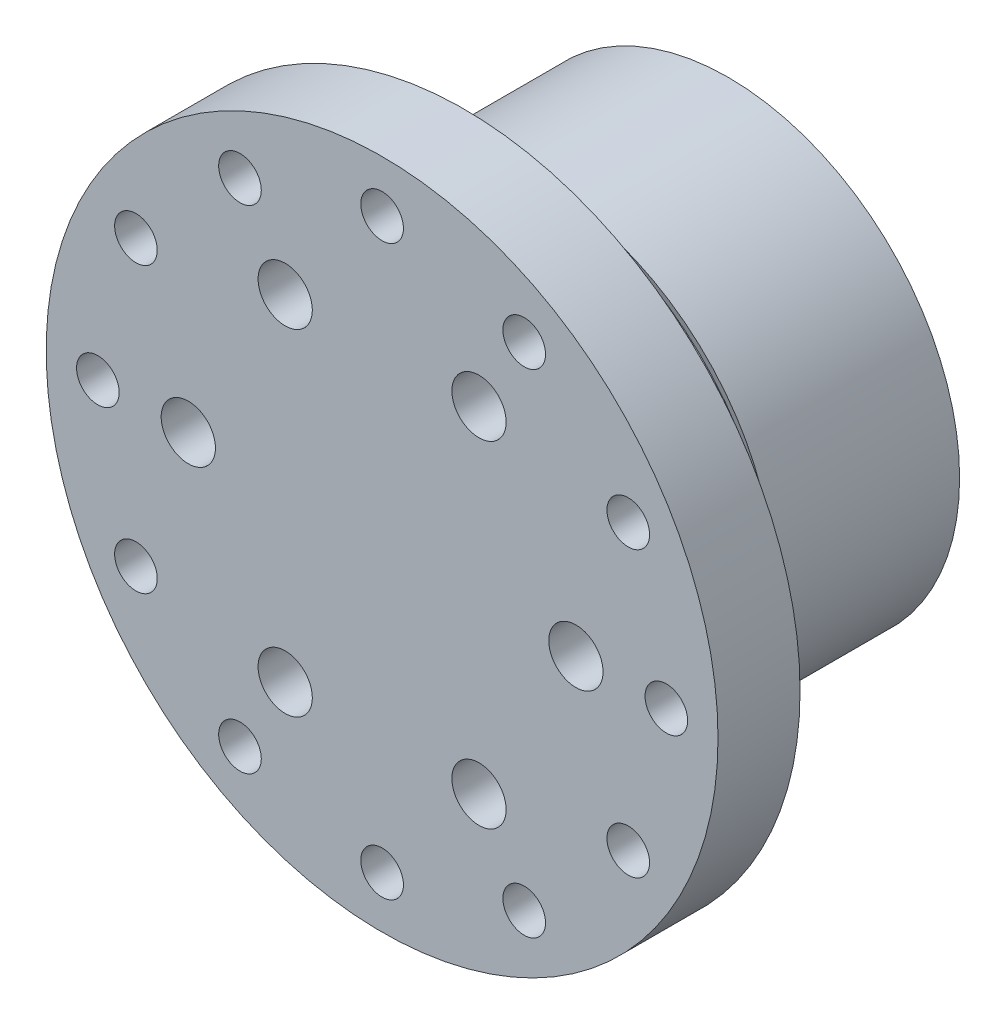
ISO-10303-21;
HEADER;
FILE_DESCRIPTION(('STEP AP214'),'2;1');
FILE_NAME('part.step','',(''),(''),'','','');
FILE_SCHEMA(('AUTOMOTIVE_DESIGN { 1 0 10303 214 1 1 1 1 }'));
ENDSEC;
DATA;
#1=APPLICATION_CONTEXT('core data for automotive mechanical design processes');
#2=APPLICATION_PROTOCOL_DEFINITION('international standard','automotive_design',2000,#1);
#3=PRODUCT_CONTEXT('',#1,'mechanical');
#4=PRODUCT('Part','Part','',(#3));
#5=PRODUCT_RELATED_PRODUCT_CATEGORY('part','',(#4));
#6=PRODUCT_DEFINITION_FORMATION('','',#4);
#7=PRODUCT_DEFINITION_CONTEXT('part definition',#1,'design');
#8=PRODUCT_DEFINITION('design','',#6,#7);
#9=PRODUCT_DEFINITION_SHAPE('','',#8);
#10=(LENGTH_UNIT() NAMED_UNIT(*) SI_UNIT(.MILLI.,.METRE.));
#11=(NAMED_UNIT(*) PLANE_ANGLE_UNIT() SI_UNIT($,.RADIAN.));
#12=(NAMED_UNIT(*) SI_UNIT($,.STERADIAN.) SOLID_ANGLE_UNIT());
#13=UNCERTAINTY_MEASURE_WITH_UNIT(LENGTH_MEASURE(1.E-05),#10,'distance_accuracy_value','');
#14=(GEOMETRIC_REPRESENTATION_CONTEXT(3) GLOBAL_UNCERTAINTY_ASSIGNED_CONTEXT((#13)) GLOBAL_UNIT_ASSIGNED_CONTEXT((#10,
#11,#12)) REPRESENTATION_CONTEXT('',''));
#15=CARTESIAN_POINT('',(0.,0.,0.));
#16=DIRECTION('',(0.,0.,1.));
#17=DIRECTION('',(1.,0.,0.));
#18=AXIS2_PLACEMENT_3D('',#15,#16,#17);
#19=CARTESIAN_POINT('',(0.,0.,0.));
#20=DIRECTION('',(0.,0.,1.));
#21=DIRECTION('',(1.,0.,0.));
#22=AXIS2_PLACEMENT_3D('',#19,#20,#21);
#23=PLANE('',#22);
#24=CARTESIAN_POINT('',(7.5,-12.9903810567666,0.));
#25=DIRECTION('',(0.,0.,1.));
#26=DIRECTION('',(1.,0.,0.));
#27=AXIS2_PLACEMENT_3D('',#24,#25,#26);
#28=CIRCLE('',#27,2.1);
#29=CARTESIAN_POINT('',(9.6,-12.9903810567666,0.));
#30=VERTEX_POINT('',#29);
#31=EDGE_CURVE('E153',#30,#30,#28,.T.);
#32=ORIENTED_EDGE('',*,*,#31,.T.);
#33=EDGE_LOOP('',(#32));
#34=FACE_BOUND('',#33,.T.);
#35=CARTESIAN_POINT('',(-7.5,-12.9903810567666,0.));
#36=DIRECTION('',(0.,0.,1.));
#37=DIRECTION('',(1.,0.,0.));
#38=AXIS2_PLACEMENT_3D('',#35,#36,#37);
#39=CIRCLE('',#38,2.1);
#40=CARTESIAN_POINT('',(-5.4,-12.9903810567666,0.));
#41=VERTEX_POINT('',#40);
#42=EDGE_CURVE('E162',#41,#41,#39,.T.);
#43=ORIENTED_EDGE('',*,*,#42,.T.);
#44=EDGE_LOOP('',(#43));
#45=FACE_BOUND('',#44,.T.);
#46=CARTESIAN_POINT('',(-15.,0.,0.));
#47=DIRECTION('',(0.,0.,1.));
#48=DIRECTION('',(1.,0.,0.));
#49=AXIS2_PLACEMENT_3D('',#46,#47,#48);
#50=CIRCLE('',#49,2.1);
#51=CARTESIAN_POINT('',(-12.9,0.,0.));
#52=VERTEX_POINT('',#51);
#53=EDGE_CURVE('E167',#52,#52,#50,.T.);
#54=ORIENTED_EDGE('',*,*,#53,.T.);
#55=EDGE_LOOP('',(#54));
#56=FACE_BOUND('',#55,.T.);
#57=CARTESIAN_POINT('',(-7.50000000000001,12.9903810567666,0.));
#58=DIRECTION('',(0.,0.,1.));
#59=DIRECTION('',(1.,0.,0.));
#60=AXIS2_PLACEMENT_3D('',#57,#58,#59);
#61=CIRCLE('',#60,2.1);
#62=CARTESIAN_POINT('',(-5.40000000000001,12.9903810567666,0.));
#63=VERTEX_POINT('',#62);
#64=EDGE_CURVE('E174',#63,#63,#61,.T.);
#65=ORIENTED_EDGE('',*,*,#64,.T.);
#66=EDGE_LOOP('',(#65));
#67=FACE_BOUND('',#66,.T.);
#68=CARTESIAN_POINT('',(7.5,12.9903810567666,0.));
#69=DIRECTION('',(0.,0.,1.));
#70=DIRECTION('',(1.,0.,0.));
#71=AXIS2_PLACEMENT_3D('',#68,#69,#70);
#72=CIRCLE('',#71,2.1);
#73=CARTESIAN_POINT('',(9.6,12.9903810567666,0.));
#74=VERTEX_POINT('',#73);
#75=EDGE_CURVE('E164',#74,#74,#72,.T.);
#76=ORIENTED_EDGE('',*,*,#75,.T.);
#77=EDGE_LOOP('',(#76));
#78=FACE_BOUND('',#77,.T.);
#79=CARTESIAN_POINT('',(15.,0.,0.));
#80=DIRECTION('',(0.,0.,1.));
#81=DIRECTION('',(1.,0.,0.));
#82=AXIS2_PLACEMENT_3D('',#79,#80,#81);
#83=CIRCLE('',#82,2.1);
#84=CARTESIAN_POINT('',(17.1,0.,0.));
#85=VERTEX_POINT('',#84);
#86=EDGE_CURVE('E149',#85,#85,#83,.T.);
#87=ORIENTED_EDGE('',*,*,#86,.T.);
#88=EDGE_LOOP('',(#87));
#89=FACE_BOUND('',#88,.T.);
#90=CARTESIAN_POINT('',(-12.3408620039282,-7.12500000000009,0.));
#91=DIRECTION('',(0.,0.,-1.));
#92=DIRECTION('',(-1.,0.,0.));
#93=AXIS2_PLACEMENT_3D('',#90,#91,#92);
#94=CIRCLE('',#93,3.);
#95=CARTESIAN_POINT('',(-15.3408620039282,-7.12500000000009,0.));
#96=VERTEX_POINT('',#95);
#97=EDGE_CURVE('E367',#96,#96,#94,.T.);
#98=ORIENTED_EDGE('',*,*,#97,.F.);
#99=EDGE_LOOP('',(#98));
#100=FACE_BOUND('',#99,.T.);
#101=CARTESIAN_POINT('',(0.,14.25,0.));
#102=DIRECTION('',(0.,0.,-1.));
#103=DIRECTION('',(-1.,0.,0.));
#104=AXIS2_PLACEMENT_3D('',#101,#102,#103);
#105=CIRCLE('',#104,3.);
#106=CARTESIAN_POINT('',(-3.00000000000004,14.25,0.));
#107=VERTEX_POINT('',#106);
#108=EDGE_CURVE('E382',#107,#107,#105,.T.);
#109=ORIENTED_EDGE('',*,*,#108,.F.);
#110=EDGE_LOOP('',(#109));
#111=FACE_BOUND('',#110,.T.);
#112=CARTESIAN_POINT('',(12.3408620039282,-7.12500000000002,0.));
#113=DIRECTION('',(0.,0.,-1.));
#114=DIRECTION('',(-1.,0.,0.));
#115=AXIS2_PLACEMENT_3D('',#112,#113,#114);
#116=CIRCLE('',#115,3.);
#117=CARTESIAN_POINT('',(9.34086200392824,-7.12500000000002,0.));
#118=VERTEX_POINT('',#117);
#119=EDGE_CURVE('E383',#118,#118,#116,.T.);
#120=ORIENTED_EDGE('',*,*,#119,.F.);
#121=EDGE_LOOP('',(#120));
#122=FACE_BOUND('',#121,.T.);
#123=CARTESIAN_POINT('',(0.,0.,0.));
#124=DIRECTION('',(0.,0.,-1.));
#125=DIRECTION('',(-1.,0.,0.));
#126=AXIS2_PLACEMENT_3D('',#123,#124,#125);
#127=CIRCLE('',#126,17.9);
#128=CARTESIAN_POINT('',(-17.9,0.,0.));
#129=VERTEX_POINT('',#128);
#130=EDGE_CURVE('E427',#129,#129,#127,.T.);
#131=ORIENTED_EDGE('',*,*,#130,.T.);
#132=EDGE_LOOP('',(#131));
#133=FACE_BOUND('',#132,.T.);
#134=ADVANCED_FACE('F48',(#34,#45,#56,#67,#78,#89,#100,#111,#122,#133),#23,.F.);
#135=CARTESIAN_POINT('',(0.,0.,20.45));
#136=DIRECTION('',(0.,0.,-1.));
#137=DIRECTION('',(-1.,0.,0.));
#138=AXIS2_PLACEMENT_3D('',#135,#136,#137);
#139=CYLINDRICAL_SURFACE('',#138,18.9);
#140=CARTESIAN_POINT('',(0.,0.,15.35));
#141=DIRECTION('',(0.,0.,1.));
#142=DIRECTION('',(1.,0.,0.));
#143=AXIS2_PLACEMENT_3D('',#140,#141,#142);
#144=CIRCLE('',#143,18.9);
#145=CARTESIAN_POINT('',(18.9,0.,15.35));
#146=VERTEX_POINT('',#145);
#147=EDGE_CURVE('E440',#146,#146,#144,.F.);
#148=ORIENTED_EDGE('',*,*,#147,.F.);
#149=EDGE_LOOP('',(#148));
#150=FACE_BOUND('',#149,.T.);
#151=CARTESIAN_POINT('',(0.,0.,20.45));
#152=DIRECTION('',(0.,0.,1.));
#153=DIRECTION('',(1.,0.,0.));
#154=AXIS2_PLACEMENT_3D('',#151,#152,#153);
#155=CIRCLE('',#154,18.9);
#156=CARTESIAN_POINT('',(18.9,0.,20.45));
#157=VERTEX_POINT('',#156);
#158=EDGE_CURVE('E60',#157,#157,#155,.T.);
#159=ORIENTED_EDGE('',*,*,#158,.F.);
#160=EDGE_LOOP('',(#159));
#161=FACE_BOUND('',#160,.T.);
#162=ADVANCED_FACE('F270',(#150,#161),#139,.T.);
#163=CARTESIAN_POINT('',(0.,0.,26.8));
#164=DIRECTION('',(0.,0.,-1.));
#165=DIRECTION('',(-1.,0.,0.));
#166=AXIS2_PLACEMENT_3D('',#163,#164,#165);
#167=CYLINDRICAL_SURFACE('',#166,26.);
#168=CARTESIAN_POINT('',(0.,0.,26.8));
#169=DIRECTION('',(0.,0.,1.));
#170=DIRECTION('',(1.,0.,0.));
#171=AXIS2_PLACEMENT_3D('',#168,#169,#170);
#172=CIRCLE('',#171,26.);
#173=CARTESIAN_POINT('',(26.,0.,26.8));
#174=VERTEX_POINT('',#173);
#175=EDGE_CURVE('E61',#174,#174,#172,.T.);
#176=ORIENTED_EDGE('',*,*,#175,.F.);
#177=EDGE_LOOP('',(#176));
#178=FACE_BOUND('',#177,.T.);
#179=CARTESIAN_POINT('',(0.,0.,20.45));
#180=DIRECTION('',(0.,0.,1.));
#181=DIRECTION('',(1.,0.,0.));
#182=AXIS2_PLACEMENT_3D('',#179,#180,#181);
#183=CIRCLE('',#182,26.);
#184=CARTESIAN_POINT('',(26.,0.,20.45));
#185=VERTEX_POINT('',#184);
#186=EDGE_CURVE('E66',#185,#185,#183,.T.);
#187=ORIENTED_EDGE('',*,*,#186,.T.);
#188=EDGE_LOOP('',(#187));
#189=FACE_BOUND('',#188,.T.);
#190=ADVANCED_FACE('F91',(#178,#189),#167,.T.);
#191=CARTESIAN_POINT('',(0.,0.,26.8));
#192=DIRECTION('',(0.,0.,1.));
#193=DIRECTION('',(1.,0.,0.));
#194=AXIS2_PLACEMENT_3D('',#191,#192,#193);
#195=PLANE('',#194);
#196=CARTESIAN_POINT('',(-10.9999999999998,19.0525588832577,26.8));
#197=DIRECTION('',(0.,0.,1.));
#198=DIRECTION('',(1.,0.,0.));
#199=AXIS2_PLACEMENT_3D('',#196,#197,#198);
#200=CIRCLE('',#199,1.65);
#201=CARTESIAN_POINT('',(-9.34999999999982,19.0525588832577,26.8));
#202=VERTEX_POINT('',#201);
#203=EDGE_CURVE('E408',#202,#202,#200,.T.);
#204=ORIENTED_EDGE('',*,*,#203,.F.);
#205=EDGE_LOOP('',(#204));
#206=FACE_BOUND('',#205,.T.);
#207=CARTESIAN_POINT('',(-19.0525588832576,11.0000000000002,26.8));
#208=DIRECTION('',(0.,0.,1.));
#209=DIRECTION('',(1.,0.,0.));
#210=AXIS2_PLACEMENT_3D('',#207,#208,#209);
#211=CIRCLE('',#210,1.65);
#212=CARTESIAN_POINT('',(-17.4025588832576,11.0000000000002,26.8));
#213=VERTEX_POINT('',#212);
#214=EDGE_CURVE('E411',#213,#213,#211,.T.);
#215=ORIENTED_EDGE('',*,*,#214,.F.);
#216=EDGE_LOOP('',(#215));
#217=FACE_BOUND('',#216,.T.);
#218=CARTESIAN_POINT('',(-22.,1.53625178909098E-13,26.8));
#219=DIRECTION('',(0.,0.,1.));
#220=DIRECTION('',(1.,0.,0.));
#221=AXIS2_PLACEMENT_3D('',#218,#219,#220);
#222=CIRCLE('',#221,1.65);
#223=CARTESIAN_POINT('',(-20.35,1.53625178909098E-13,26.8));
#224=VERTEX_POINT('',#223);
#225=EDGE_CURVE('E420',#224,#224,#222,.T.);
#226=ORIENTED_EDGE('',*,*,#225,.F.);
#227=EDGE_LOOP('',(#226));
#228=FACE_BOUND('',#227,.T.);
#229=CARTESIAN_POINT('',(-19.0525588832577,-10.9999999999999,26.8));
#230=DIRECTION('',(0.,0.,1.));
#231=DIRECTION('',(1.,0.,0.));
#232=AXIS2_PLACEMENT_3D('',#229,#230,#231);
#233=CIRCLE('',#232,1.65);
#234=CARTESIAN_POINT('',(-17.4025588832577,-10.9999999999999,26.8));
#235=VERTEX_POINT('',#234);
#236=EDGE_CURVE('E400',#235,#235,#233,.T.);
#237=ORIENTED_EDGE('',*,*,#236,.F.);
#238=EDGE_LOOP('',(#237));
#239=FACE_BOUND('',#238,.T.);
#240=CARTESIAN_POINT('',(-11.0000000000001,-19.0525588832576,26.8));
#241=DIRECTION('',(0.,0.,1.));
#242=DIRECTION('',(1.,0.,0.));
#243=AXIS2_PLACEMENT_3D('',#240,#241,#242);
#244=CIRCLE('',#243,1.65);
#245=CARTESIAN_POINT('',(-9.35000000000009,-19.0525588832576,26.8));
#246=VERTEX_POINT('',#245);
#247=EDGE_CURVE('E391',#246,#246,#244,.T.);
#248=ORIENTED_EDGE('',*,*,#247,.F.);
#249=EDGE_LOOP('',(#248));
#250=FACE_BOUND('',#249,.T.);
#251=CARTESIAN_POINT('',(0.,-22.,26.8));
#252=DIRECTION('',(0.,0.,1.));
#253=DIRECTION('',(1.,0.,0.));
#254=AXIS2_PLACEMENT_3D('',#251,#252,#253);
#255=CIRCLE('',#254,1.65);
#256=CARTESIAN_POINT('',(1.64999999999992,-22.,26.8));
#257=VERTEX_POINT('',#256);
#258=EDGE_CURVE('E399',#257,#257,#255,.T.);
#259=ORIENTED_EDGE('',*,*,#258,.F.);
#260=EDGE_LOOP('',(#259));
#261=FACE_BOUND('',#260,.T.);
#262=CARTESIAN_POINT('',(11.,-19.0525588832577,26.8));
#263=DIRECTION('',(0.,0.,1.));
#264=DIRECTION('',(1.,0.,0.));
#265=AXIS2_PLACEMENT_3D('',#262,#263,#264);
#266=CIRCLE('',#265,1.65);
#267=CARTESIAN_POINT('',(12.65,-19.0525588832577,26.8));
#268=VERTEX_POINT('',#267);
#269=EDGE_CURVE('E405',#268,#268,#266,.T.);
#270=ORIENTED_EDGE('',*,*,#269,.F.);
#271=EDGE_LOOP('',(#270));
#272=FACE_BOUND('',#271,.T.);
#273=CARTESIAN_POINT('',(19.0525588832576,-11.,26.8));
#274=DIRECTION('',(0.,0.,1.));
#275=DIRECTION('',(1.,0.,0.));
#276=AXIS2_PLACEMENT_3D('',#273,#274,#275);
#277=CIRCLE('',#276,1.65);
#278=CARTESIAN_POINT('',(20.7025588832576,-11.,26.8));
#279=VERTEX_POINT('',#278);
#280=EDGE_CURVE('E342',#279,#279,#277,.T.);
#281=ORIENTED_EDGE('',*,*,#280,.F.);
#282=EDGE_LOOP('',(#281));
#283=FACE_BOUND('',#282,.T.);
#284=CARTESIAN_POINT('',(2.30437768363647E-13,22.,26.8));
#285=DIRECTION('',(0.,0.,1.));
#286=DIRECTION('',(1.,0.,0.));
#287=AXIS2_PLACEMENT_3D('',#284,#285,#286);
#288=CIRCLE('',#287,1.65);
#289=CARTESIAN_POINT('',(1.65000000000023,22.,26.8));
#290=VERTEX_POINT('',#289);
#291=EDGE_CURVE('E412',#290,#290,#288,.T.);
#292=ORIENTED_EDGE('',*,*,#291,.F.);
#293=EDGE_LOOP('',(#292));
#294=FACE_BOUND('',#293,.T.);
#295=CARTESIAN_POINT('',(11.0000000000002,19.0525588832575,26.8));
#296=DIRECTION('',(0.,0.,1.));
#297=DIRECTION('',(1.,0.,0.));
#298=AXIS2_PLACEMENT_3D('',#295,#296,#297);
#299=CIRCLE('',#298,1.65);
#300=CARTESIAN_POINT('',(12.6500000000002,19.0525588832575,26.8));
#301=VERTEX_POINT('',#300);
#302=EDGE_CURVE('E429',#301,#301,#299,.T.);
#303=ORIENTED_EDGE('',*,*,#302,.F.);
#304=EDGE_LOOP('',(#303));
#305=FACE_BOUND('',#304,.T.);
#306=CARTESIAN_POINT('',(19.0525588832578,10.9999999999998,26.8));
#307=DIRECTION('',(0.,0.,1.));
#308=DIRECTION('',(1.,0.,0.));
#309=AXIS2_PLACEMENT_3D('',#306,#307,#308);
#310=CIRCLE('',#309,1.65);
#311=CARTESIAN_POINT('',(20.7025588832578,10.9999999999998,26.8));
#312=VERTEX_POINT('',#311);
#313=EDGE_CURVE('E424',#312,#312,#310,.T.);
#314=ORIENTED_EDGE('',*,*,#313,.F.);
#315=EDGE_LOOP('',(#314));
#316=FACE_BOUND('',#315,.T.);
#317=CARTESIAN_POINT('',(22.,0.,26.8));
#318=DIRECTION('',(0.,0.,1.));
#319=DIRECTION('',(1.,0.,0.));
#320=AXIS2_PLACEMENT_3D('',#317,#318,#319);
#321=CIRCLE('',#320,1.65);
#322=CARTESIAN_POINT('',(23.65,0.,26.8));
#323=VERTEX_POINT('',#322);
#324=EDGE_CURVE('E338',#323,#323,#321,.T.);
#325=ORIENTED_EDGE('',*,*,#324,.F.);
#326=EDGE_LOOP('',(#325));
#327=FACE_BOUND('',#326,.T.);
#328=CARTESIAN_POINT('',(15.,0.,26.800012));
#329=DIRECTION('',(0.,0.,1.));
#330=DIRECTION('',(1.,0.,0.));
#331=AXIS2_PLACEMENT_3D('',#328,#329,#330);
#332=CIRCLE('',#331,2.1);
#333=CARTESIAN_POINT('',(17.1,0.,26.800012));
#334=VERTEX_POINT('',#333);
#335=EDGE_CURVE('E145',#334,#334,#332,.T.);
#336=ORIENTED_EDGE('',*,*,#335,.F.);
#337=EDGE_LOOP('',(#336));
#338=FACE_BOUND('',#337,.T.);
#339=CARTESIAN_POINT('',(7.5,12.9903810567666,26.800012));
#340=DIRECTION('',(0.,0.,1.));
#341=DIRECTION('',(1.,0.,0.));
#342=AXIS2_PLACEMENT_3D('',#339,#340,#341);
#343=CIRCLE('',#342,2.1);
#344=CARTESIAN_POINT('',(9.6,12.9903810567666,26.800012));
#345=VERTEX_POINT('',#344);
#346=EDGE_CURVE('E133',#345,#345,#343,.T.);
#347=ORIENTED_EDGE('',*,*,#346,.F.);
#348=EDGE_LOOP('',(#347));
#349=FACE_BOUND('',#348,.T.);
#350=CARTESIAN_POINT('',(-7.50000000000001,12.9903810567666,26.800012));
#351=DIRECTION('',(0.,0.,1.));
#352=DIRECTION('',(1.,0.,0.));
#353=AXIS2_PLACEMENT_3D('',#350,#351,#352);
#354=CIRCLE('',#353,2.1);
#355=CARTESIAN_POINT('',(-5.40000000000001,12.9903810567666,26.800012));
#356=VERTEX_POINT('',#355);
#357=EDGE_CURVE('E172',#356,#356,#354,.T.);
#358=ORIENTED_EDGE('',*,*,#357,.F.);
#359=EDGE_LOOP('',(#358));
#360=FACE_BOUND('',#359,.T.);
#361=CARTESIAN_POINT('',(-15.,0.,26.800012));
#362=DIRECTION('',(0.,0.,1.));
#363=DIRECTION('',(1.,0.,0.));
#364=AXIS2_PLACEMENT_3D('',#361,#362,#363);
#365=CIRCLE('',#364,2.1);
#366=CARTESIAN_POINT('',(-12.9,0.,26.800012));
#367=VERTEX_POINT('',#366);
#368=EDGE_CURVE('E169',#367,#367,#365,.T.);
#369=ORIENTED_EDGE('',*,*,#368,.F.);
#370=EDGE_LOOP('',(#369));
#371=FACE_BOUND('',#370,.T.);
#372=CARTESIAN_POINT('',(-7.5,-12.9903810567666,26.800012));
#373=DIRECTION('',(0.,0.,1.));
#374=DIRECTION('',(1.,0.,0.));
#375=AXIS2_PLACEMENT_3D('',#372,#373,#374);
#376=CIRCLE('',#375,2.1);
#377=CARTESIAN_POINT('',(-5.4,-12.9903810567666,26.800012));
#378=VERTEX_POINT('',#377);
#379=EDGE_CURVE('E157',#378,#378,#376,.T.);
#380=ORIENTED_EDGE('',*,*,#379,.F.);
#381=EDGE_LOOP('',(#380));
#382=FACE_BOUND('',#381,.T.);
#383=CARTESIAN_POINT('',(7.5,-12.9903810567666,26.800012));
#384=DIRECTION('',(0.,0.,1.));
#385=DIRECTION('',(1.,0.,0.));
#386=AXIS2_PLACEMENT_3D('',#383,#384,#385);
#387=CIRCLE('',#386,2.1);
#388=CARTESIAN_POINT('',(9.6,-12.9903810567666,26.800012));
#389=VERTEX_POINT('',#388);
#390=EDGE_CURVE('E77',#389,#389,#387,.T.);
#391=ORIENTED_EDGE('',*,*,#390,.F.);
#392=EDGE_LOOP('',(#391));
#393=FACE_BOUND('',#392,.T.);
#394=ORIENTED_EDGE('',*,*,#175,.T.);
#395=EDGE_LOOP('',(#394));
#396=FACE_BOUND('',#395,.T.);
#397=ADVANCED_FACE('F85',(#206,#217,#228,#239,#250,#261,#272,#283,#294,#305,#316,#327,#338,#349,
#360,#371,#382,#393,#396),#195,.T.);
#398=CARTESIAN_POINT('',(0.,0.,20.45));
#399=DIRECTION('',(0.,0.,1.));
#400=DIRECTION('',(1.,0.,0.));
#401=AXIS2_PLACEMENT_3D('',#398,#399,#400);
#402=PLANE('',#401);
#403=CARTESIAN_POINT('',(-10.9999999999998,19.0525588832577,20.45));
#404=DIRECTION('',(0.,0.,1.));
#405=DIRECTION('',(1.,0.,0.));
#406=AXIS2_PLACEMENT_3D('',#403,#404,#405);
#407=CIRCLE('',#406,1.65);
#408=CARTESIAN_POINT('',(-9.34999999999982,19.0525588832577,20.45));
#409=VERTEX_POINT('',#408);
#410=EDGE_CURVE('E295',#409,#409,#407,.T.);
#411=ORIENTED_EDGE('',*,*,#410,.T.);
#412=EDGE_LOOP('',(#411));
#413=FACE_BOUND('',#412,.T.);
#414=CARTESIAN_POINT('',(-19.0525588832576,11.0000000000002,20.45));
#415=DIRECTION('',(0.,0.,1.));
#416=DIRECTION('',(1.,0.,0.));
#417=AXIS2_PLACEMENT_3D('',#414,#415,#416);
#418=CIRCLE('',#417,1.65);
#419=CARTESIAN_POINT('',(-17.4025588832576,11.0000000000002,20.45));
#420=VERTEX_POINT('',#419);
#421=EDGE_CURVE('E296',#420,#420,#418,.T.);
#422=ORIENTED_EDGE('',*,*,#421,.T.);
#423=EDGE_LOOP('',(#422));
#424=FACE_BOUND('',#423,.T.);
#425=CARTESIAN_POINT('',(-22.,1.53625178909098E-13,20.45));
#426=DIRECTION('',(0.,0.,1.));
#427=DIRECTION('',(1.,0.,0.));
#428=AXIS2_PLACEMENT_3D('',#425,#426,#427);
#429=CIRCLE('',#428,1.65);
#430=CARTESIAN_POINT('',(-20.35,1.53625178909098E-13,20.45));
#431=VERTEX_POINT('',#430);
#432=EDGE_CURVE('E305',#431,#431,#429,.T.);
#433=ORIENTED_EDGE('',*,*,#432,.T.);
#434=EDGE_LOOP('',(#433));
#435=FACE_BOUND('',#434,.T.);
#436=CARTESIAN_POINT('',(-19.0525588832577,-10.9999999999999,20.45));
#437=DIRECTION('',(0.,0.,1.));
#438=DIRECTION('',(1.,0.,0.));
#439=AXIS2_PLACEMENT_3D('',#436,#437,#438);
#440=CIRCLE('',#439,1.65);
#441=CARTESIAN_POINT('',(-17.4025588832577,-10.9999999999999,20.45));
#442=VERTEX_POINT('',#441);
#443=EDGE_CURVE('E306',#442,#442,#440,.T.);
#444=ORIENTED_EDGE('',*,*,#443,.T.);
#445=EDGE_LOOP('',(#444));
#446=FACE_BOUND('',#445,.T.);
#447=CARTESIAN_POINT('',(-11.0000000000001,-19.0525588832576,20.45));
#448=DIRECTION('',(0.,0.,1.));
#449=DIRECTION('',(1.,0.,0.));
#450=AXIS2_PLACEMENT_3D('',#447,#448,#449);
#451=CIRCLE('',#450,1.65);
#452=CARTESIAN_POINT('',(-9.35000000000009,-19.0525588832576,20.45));
#453=VERTEX_POINT('',#452);
#454=EDGE_CURVE('E309',#453,#453,#451,.T.);
#455=ORIENTED_EDGE('',*,*,#454,.T.);
#456=EDGE_LOOP('',(#455));
#457=FACE_BOUND('',#456,.T.);
#458=CARTESIAN_POINT('',(0.,-22.,20.45));
#459=DIRECTION('',(0.,0.,1.));
#460=DIRECTION('',(1.,0.,0.));
#461=AXIS2_PLACEMENT_3D('',#458,#459,#460);
#462=CIRCLE('',#461,1.65);
#463=CARTESIAN_POINT('',(1.64999999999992,-22.,20.45));
#464=VERTEX_POINT('',#463);
#465=EDGE_CURVE('E313',#464,#464,#462,.T.);
#466=ORIENTED_EDGE('',*,*,#465,.T.);
#467=EDGE_LOOP('',(#466));
#468=FACE_BOUND('',#467,.T.);
#469=CARTESIAN_POINT('',(11.,-19.0525588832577,20.45));
#470=DIRECTION('',(0.,0.,1.));
#471=DIRECTION('',(1.,0.,0.));
#472=AXIS2_PLACEMENT_3D('',#469,#470,#471);
#473=CIRCLE('',#472,1.65);
#474=CARTESIAN_POINT('',(12.65,-19.0525588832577,20.45));
#475=VERTEX_POINT('',#474);
#476=EDGE_CURVE('E319',#475,#475,#473,.T.);
#477=ORIENTED_EDGE('',*,*,#476,.T.);
#478=EDGE_LOOP('',(#477));
#479=FACE_BOUND('',#478,.T.);
#480=CARTESIAN_POINT('',(19.0525588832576,-11.,20.45));
#481=DIRECTION('',(0.,0.,1.));
#482=DIRECTION('',(1.,0.,0.));
#483=AXIS2_PLACEMENT_3D('',#480,#481,#482);
#484=CIRCLE('',#483,1.65);
#485=CARTESIAN_POINT('',(20.7025588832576,-11.,20.45));
#486=VERTEX_POINT('',#485);
#487=EDGE_CURVE('E321',#486,#486,#484,.T.);
#488=ORIENTED_EDGE('',*,*,#487,.T.);
#489=EDGE_LOOP('',(#488));
#490=FACE_BOUND('',#489,.T.);
#491=CARTESIAN_POINT('',(2.30437768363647E-13,22.,20.45));
#492=DIRECTION('',(0.,0.,1.));
#493=DIRECTION('',(1.,0.,0.));
#494=AXIS2_PLACEMENT_3D('',#491,#492,#493);
#495=CIRCLE('',#494,1.65);
#496=CARTESIAN_POINT('',(1.65000000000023,22.,20.45));
#497=VERTEX_POINT('',#496);
#498=EDGE_CURVE('E328',#497,#497,#495,.T.);
#499=ORIENTED_EDGE('',*,*,#498,.T.);
#500=EDGE_LOOP('',(#499));
#501=FACE_BOUND('',#500,.T.);
#502=CARTESIAN_POINT('',(11.0000000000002,19.0525588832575,20.45));
#503=DIRECTION('',(0.,0.,1.));
#504=DIRECTION('',(1.,0.,0.));
#505=AXIS2_PLACEMENT_3D('',#502,#503,#504);
#506=CIRCLE('',#505,1.65);
#507=CARTESIAN_POINT('',(12.6500000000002,19.0525588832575,20.45));
#508=VERTEX_POINT('',#507);
#509=EDGE_CURVE('E329',#508,#508,#506,.T.);
#510=ORIENTED_EDGE('',*,*,#509,.T.);
#511=EDGE_LOOP('',(#510));
#512=FACE_BOUND('',#511,.T.);
#513=CARTESIAN_POINT('',(19.0525588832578,10.9999999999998,20.45));
#514=DIRECTION('',(0.,0.,1.));
#515=DIRECTION('',(1.,0.,0.));
#516=AXIS2_PLACEMENT_3D('',#513,#514,#515);
#517=CIRCLE('',#516,1.65);
#518=CARTESIAN_POINT('',(20.7025588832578,10.9999999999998,20.45));
#519=VERTEX_POINT('',#518);
#520=EDGE_CURVE('E331',#519,#519,#517,.T.);
#521=ORIENTED_EDGE('',*,*,#520,.T.);
#522=EDGE_LOOP('',(#521));
#523=FACE_BOUND('',#522,.T.);
#524=CARTESIAN_POINT('',(22.,0.,20.45));
#525=DIRECTION('',(0.,0.,1.));
#526=DIRECTION('',(1.,0.,0.));
#527=AXIS2_PLACEMENT_3D('',#524,#525,#526);
#528=CIRCLE('',#527,1.65);
#529=CARTESIAN_POINT('',(23.65,0.,20.45));
#530=VERTEX_POINT('',#529);
#531=EDGE_CURVE('E340',#530,#530,#528,.T.);
#532=ORIENTED_EDGE('',*,*,#531,.T.);
#533=EDGE_LOOP('',(#532));
#534=FACE_BOUND('',#533,.T.);
#535=ORIENTED_EDGE('',*,*,#158,.T.);
#536=EDGE_LOOP('',(#535));
#537=FACE_BOUND('',#536,.T.);
#538=ORIENTED_EDGE('',*,*,#186,.F.);
#539=EDGE_LOOP('',(#538));
#540=FACE_BOUND('',#539,.T.);
#541=ADVANCED_FACE('F95',(#413,#424,#435,#446,#457,#468,#479,#490,#501,#512,#523,#534,#537,
#540),#402,.F.);
#542=CARTESIAN_POINT('',(7.5,-12.9903810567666,0.));
#543=DIRECTION('',(0.,0.,1.));
#544=DIRECTION('',(1.,0.,0.));
#545=AXIS2_PLACEMENT_3D('',#542,#543,#544);
#546=CYLINDRICAL_SURFACE('',#545,2.1);
#547=ORIENTED_EDGE('',*,*,#31,.F.);
#548=EDGE_LOOP('',(#547));
#549=FACE_BOUND('',#548,.T.);
#550=ORIENTED_EDGE('',*,*,#390,.T.);
#551=EDGE_LOOP('',(#550));
#552=FACE_BOUND('',#551,.T.);
#553=ADVANCED_FACE('F205',(#549,#552),#546,.F.);
#554=CARTESIAN_POINT('',(-7.5,-12.9903810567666,0.));
#555=DIRECTION('',(0.,0.,1.));
#556=DIRECTION('',(1.,0.,0.));
#557=AXIS2_PLACEMENT_3D('',#554,#555,#556);
#558=CYLINDRICAL_SURFACE('',#557,2.1);
#559=ORIENTED_EDGE('',*,*,#42,.F.);
#560=EDGE_LOOP('',(#559));
#561=FACE_BOUND('',#560,.T.);
#562=ORIENTED_EDGE('',*,*,#379,.T.);
#563=EDGE_LOOP('',(#562));
#564=FACE_BOUND('',#563,.T.);
#565=ADVANCED_FACE('F241',(#561,#564),#558,.F.);
#566=CARTESIAN_POINT('',(-15.,0.,0.));
#567=DIRECTION('',(0.,0.,1.));
#568=DIRECTION('',(1.,0.,0.));
#569=AXIS2_PLACEMENT_3D('',#566,#567,#568);
#570=CYLINDRICAL_SURFACE('',#569,2.1);
#571=ORIENTED_EDGE('',*,*,#53,.F.);
#572=EDGE_LOOP('',(#571));
#573=FACE_BOUND('',#572,.T.);
#574=ORIENTED_EDGE('',*,*,#368,.T.);
#575=EDGE_LOOP('',(#574));
#576=FACE_BOUND('',#575,.T.);
#577=ADVANCED_FACE('F231',(#573,#576),#570,.F.);
#578=CARTESIAN_POINT('',(-7.50000000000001,12.9903810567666,0.));
#579=DIRECTION('',(0.,0.,1.));
#580=DIRECTION('',(1.,0.,0.));
#581=AXIS2_PLACEMENT_3D('',#578,#579,#580);
#582=CYLINDRICAL_SURFACE('',#581,2.1);
#583=ORIENTED_EDGE('',*,*,#64,.F.);
#584=EDGE_LOOP('',(#583));
#585=FACE_BOUND('',#584,.T.);
#586=ORIENTED_EDGE('',*,*,#357,.T.);
#587=EDGE_LOOP('',(#586));
#588=FACE_BOUND('',#587,.T.);
#589=ADVANCED_FACE('F98',(#585,#588),#582,.F.);
#590=CARTESIAN_POINT('',(7.5,12.9903810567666,0.));
#591=DIRECTION('',(0.,0.,1.));
#592=DIRECTION('',(1.,0.,0.));
#593=AXIS2_PLACEMENT_3D('',#590,#591,#592);
#594=CYLINDRICAL_SURFACE('',#593,2.1);
#595=ORIENTED_EDGE('',*,*,#75,.F.);
#596=EDGE_LOOP('',(#595));
#597=FACE_BOUND('',#596,.T.);
#598=ORIENTED_EDGE('',*,*,#346,.T.);
#599=EDGE_LOOP('',(#598));
#600=FACE_BOUND('',#599,.T.);
#601=ADVANCED_FACE('F192',(#597,#600),#594,.F.);
#602=CARTESIAN_POINT('',(15.,0.,0.));
#603=DIRECTION('',(0.,0.,1.));
#604=DIRECTION('',(1.,0.,0.));
#605=AXIS2_PLACEMENT_3D('',#602,#603,#604);
#606=CYLINDRICAL_SURFACE('',#605,2.1);
#607=ORIENTED_EDGE('',*,*,#86,.F.);
#608=EDGE_LOOP('',(#607));
#609=FACE_BOUND('',#608,.T.);
#610=ORIENTED_EDGE('',*,*,#335,.T.);
#611=EDGE_LOOP('',(#610));
#612=FACE_BOUND('',#611,.T.);
#613=ADVANCED_FACE('F183',(#609,#612),#606,.F.);
#614=CARTESIAN_POINT('',(-12.3408620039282,-7.12500000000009,4.));
#615=DIRECTION('',(0.,0.,-1.));
#616=DIRECTION('',(-1.,0.,0.));
#617=AXIS2_PLACEMENT_3D('',#614,#615,#616);
#618=CYLINDRICAL_SURFACE('',#617,3.);
#619=CARTESIAN_POINT('',(-12.3408620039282,-7.12500000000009,4.));
#620=DIRECTION('',(0.,0.,-1.));
#621=DIRECTION('',(-1.,0.,0.));
#622=AXIS2_PLACEMENT_3D('',#619,#620,#621);
#623=CIRCLE('',#622,3.);
#624=CARTESIAN_POINT('',(-15.3408620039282,-7.12500000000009,4.));
#625=VERTEX_POINT('',#624);
#626=EDGE_CURVE('E366',#625,#625,#623,.T.);
#627=ORIENTED_EDGE('',*,*,#626,.F.);
#628=EDGE_LOOP('',(#627));
#629=FACE_BOUND('',#628,.T.);
#630=ORIENTED_EDGE('',*,*,#97,.T.);
#631=EDGE_LOOP('',(#630));
#632=FACE_BOUND('',#631,.T.);
#633=ADVANCED_FACE('F193',(#629,#632),#618,.F.);
#634=CARTESIAN_POINT('',(-12.3408620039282,-7.12500000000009,4.));
#635=DIRECTION('',(0.,0.,-1.));
#636=DIRECTION('',(-1.,0.,0.));
#637=AXIS2_PLACEMENT_3D('',#634,#635,#636);
#638=PLANE('',#637);
#639=ORIENTED_EDGE('',*,*,#626,.T.);
#640=EDGE_LOOP('',(#639));
#641=FACE_BOUND('',#640,.T.);
#642=ADVANCED_FACE('F200',(#641),#638,.T.);
#643=CARTESIAN_POINT('',(0.,14.25,4.));
#644=DIRECTION('',(0.,0.,-1.));
#645=DIRECTION('',(-1.,0.,0.));
#646=AXIS2_PLACEMENT_3D('',#643,#644,#645);
#647=CYLINDRICAL_SURFACE('',#646,3.);
#648=CARTESIAN_POINT('',(0.,14.25,4.));
#649=DIRECTION('',(0.,0.,-1.));
#650=DIRECTION('',(-1.,0.,0.));
#651=AXIS2_PLACEMENT_3D('',#648,#649,#650);
#652=CIRCLE('',#651,3.);
#653=CARTESIAN_POINT('',(-3.00000000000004,14.25,4.));
#654=VERTEX_POINT('',#653);
#655=EDGE_CURVE('E374',#654,#654,#652,.T.);
#656=ORIENTED_EDGE('',*,*,#655,.F.);
#657=EDGE_LOOP('',(#656));
#658=FACE_BOUND('',#657,.T.);
#659=ORIENTED_EDGE('',*,*,#108,.T.);
#660=EDGE_LOOP('',(#659));
#661=FACE_BOUND('',#660,.T.);
#662=ADVANCED_FACE('F508',(#658,#661),#647,.F.);
#663=CARTESIAN_POINT('',(0.,14.25,4.));
#664=DIRECTION('',(0.,0.,-1.));
#665=DIRECTION('',(-1.,0.,0.));
#666=AXIS2_PLACEMENT_3D('',#663,#664,#665);
#667=PLANE('',#666);
#668=ORIENTED_EDGE('',*,*,#655,.T.);
#669=EDGE_LOOP('',(#668));
#670=FACE_BOUND('',#669,.T.);
#671=ADVANCED_FACE('F510',(#670),#667,.T.);
#672=CARTESIAN_POINT('',(12.3408620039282,-7.12500000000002,4.));
#673=DIRECTION('',(0.,0.,-1.));
#674=DIRECTION('',(-1.,0.,0.));
#675=AXIS2_PLACEMENT_3D('',#672,#673,#674);
#676=CYLINDRICAL_SURFACE('',#675,3.);
#677=CARTESIAN_POINT('',(12.3408620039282,-7.12500000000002,4.));
#678=DIRECTION('',(0.,0.,-1.));
#679=DIRECTION('',(-1.,0.,0.));
#680=AXIS2_PLACEMENT_3D('',#677,#678,#679);
#681=CIRCLE('',#680,3.);
#682=CARTESIAN_POINT('',(9.34086200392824,-7.12500000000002,4.));
#683=VERTEX_POINT('',#682);
#684=EDGE_CURVE('E388',#683,#683,#681,.T.);
#685=ORIENTED_EDGE('',*,*,#684,.F.);
#686=EDGE_LOOP('',(#685));
#687=FACE_BOUND('',#686,.T.);
#688=ORIENTED_EDGE('',*,*,#119,.T.);
#689=EDGE_LOOP('',(#688));
#690=FACE_BOUND('',#689,.T.);
#691=ADVANCED_FACE('F503',(#687,#690),#676,.F.);
#692=CARTESIAN_POINT('',(12.3408620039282,-7.12500000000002,4.));
#693=DIRECTION('',(0.,0.,-1.));
#694=DIRECTION('',(-1.,0.,0.));
#695=AXIS2_PLACEMENT_3D('',#692,#693,#694);
#696=PLANE('',#695);
#697=ORIENTED_EDGE('',*,*,#684,.T.);
#698=EDGE_LOOP('',(#697));
#699=FACE_BOUND('',#698,.T.);
#700=ADVANCED_FACE('F497',(#699),#696,.T.);
#701=CARTESIAN_POINT('',(22.,0.,0.));
#702=DIRECTION('',(0.,0.,1.));
#703=DIRECTION('',(1.,0.,0.));
#704=AXIS2_PLACEMENT_3D('',#701,#702,#703);
#705=CYLINDRICAL_SURFACE('',#704,1.65);
#706=ORIENTED_EDGE('',*,*,#324,.T.);
#707=EDGE_LOOP('',(#706));
#708=FACE_BOUND('',#707,.T.);
#709=ORIENTED_EDGE('',*,*,#531,.F.);
#710=EDGE_LOOP('',(#709));
#711=FACE_BOUND('',#710,.T.);
#712=ADVANCED_FACE('F468',(#708,#711),#705,.F.);
#713=CARTESIAN_POINT('',(19.0525588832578,10.9999999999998,0.));
#714=DIRECTION('',(0.,0.,1.));
#715=DIRECTION('',(1.,0.,0.));
#716=AXIS2_PLACEMENT_3D('',#713,#714,#715);
#717=CYLINDRICAL_SURFACE('',#716,1.65);
#718=ORIENTED_EDGE('',*,*,#313,.T.);
#719=EDGE_LOOP('',(#718));
#720=FACE_BOUND('',#719,.T.);
#721=ORIENTED_EDGE('',*,*,#520,.F.);
#722=EDGE_LOOP('',(#721));
#723=FACE_BOUND('',#722,.T.);
#724=ADVANCED_FACE('F467',(#720,#723),#717,.F.);
#725=CARTESIAN_POINT('',(11.0000000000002,19.0525588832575,0.));
#726=DIRECTION('',(0.,0.,1.));
#727=DIRECTION('',(1.,0.,0.));
#728=AXIS2_PLACEMENT_3D('',#725,#726,#727);
#729=CYLINDRICAL_SURFACE('',#728,1.65);
#730=ORIENTED_EDGE('',*,*,#302,.T.);
#731=EDGE_LOOP('',(#730));
#732=FACE_BOUND('',#731,.T.);
#733=ORIENTED_EDGE('',*,*,#509,.F.);
#734=EDGE_LOOP('',(#733));
#735=FACE_BOUND('',#734,.T.);
#736=ADVANCED_FACE('F464',(#732,#735),#729,.F.);
#737=CARTESIAN_POINT('',(2.30437768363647E-13,22.,0.));
#738=DIRECTION('',(0.,0.,1.));
#739=DIRECTION('',(1.,0.,0.));
#740=AXIS2_PLACEMENT_3D('',#737,#738,#739);
#741=CYLINDRICAL_SURFACE('',#740,1.65);
#742=ORIENTED_EDGE('',*,*,#291,.T.);
#743=EDGE_LOOP('',(#742));
#744=FACE_BOUND('',#743,.T.);
#745=ORIENTED_EDGE('',*,*,#498,.F.);
#746=EDGE_LOOP('',(#745));
#747=FACE_BOUND('',#746,.T.);
#748=ADVANCED_FACE('F456',(#744,#747),#741,.F.);
#749=CARTESIAN_POINT('',(19.0525588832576,-11.,0.));
#750=DIRECTION('',(0.,0.,1.));
#751=DIRECTION('',(1.,0.,0.));
#752=AXIS2_PLACEMENT_3D('',#749,#750,#751);
#753=CYLINDRICAL_SURFACE('',#752,1.65);
#754=ORIENTED_EDGE('',*,*,#280,.T.);
#755=EDGE_LOOP('',(#754));
#756=FACE_BOUND('',#755,.T.);
#757=ORIENTED_EDGE('',*,*,#487,.F.);
#758=EDGE_LOOP('',(#757));
#759=FACE_BOUND('',#758,.T.);
#760=ADVANCED_FACE('F462',(#756,#759),#753,.F.);
#761=CARTESIAN_POINT('',(11.,-19.0525588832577,0.));
#762=DIRECTION('',(0.,0.,1.));
#763=DIRECTION('',(1.,0.,0.));
#764=AXIS2_PLACEMENT_3D('',#761,#762,#763);
#765=CYLINDRICAL_SURFACE('',#764,1.65);
#766=ORIENTED_EDGE('',*,*,#269,.T.);
#767=EDGE_LOOP('',(#766));
#768=FACE_BOUND('',#767,.T.);
#769=ORIENTED_EDGE('',*,*,#476,.F.);
#770=EDGE_LOOP('',(#769));
#771=FACE_BOUND('',#770,.T.);
#772=ADVANCED_FACE('F488',(#768,#771),#765,.F.);
#773=CARTESIAN_POINT('',(0.,-22.,0.));
#774=DIRECTION('',(0.,0.,1.));
#775=DIRECTION('',(1.,0.,0.));
#776=AXIS2_PLACEMENT_3D('',#773,#774,#775);
#777=CYLINDRICAL_SURFACE('',#776,1.65);
#778=ORIENTED_EDGE('',*,*,#258,.T.);
#779=EDGE_LOOP('',(#778));
#780=FACE_BOUND('',#779,.T.);
#781=ORIENTED_EDGE('',*,*,#465,.F.);
#782=EDGE_LOOP('',(#781));
#783=FACE_BOUND('',#782,.T.);
#784=ADVANCED_FACE('F489',(#780,#783),#777,.F.);
#785=CARTESIAN_POINT('',(-11.0000000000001,-19.0525588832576,0.));
#786=DIRECTION('',(0.,0.,1.));
#787=DIRECTION('',(1.,0.,0.));
#788=AXIS2_PLACEMENT_3D('',#785,#786,#787);
#789=CYLINDRICAL_SURFACE('',#788,1.65);
#790=ORIENTED_EDGE('',*,*,#247,.T.);
#791=EDGE_LOOP('',(#790));
#792=FACE_BOUND('',#791,.T.);
#793=ORIENTED_EDGE('',*,*,#454,.F.);
#794=EDGE_LOOP('',(#793));
#795=FACE_BOUND('',#794,.T.);
#796=ADVANCED_FACE('F478',(#792,#795),#789,.F.);
#797=CARTESIAN_POINT('',(-19.0525588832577,-10.9999999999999,0.));
#798=DIRECTION('',(0.,0.,1.));
#799=DIRECTION('',(1.,0.,0.));
#800=AXIS2_PLACEMENT_3D('',#797,#798,#799);
#801=CYLINDRICAL_SURFACE('',#800,1.65);
#802=ORIENTED_EDGE('',*,*,#236,.T.);
#803=EDGE_LOOP('',(#802));
#804=FACE_BOUND('',#803,.T.);
#805=ORIENTED_EDGE('',*,*,#443,.F.);
#806=EDGE_LOOP('',(#805));
#807=FACE_BOUND('',#806,.T.);
#808=ADVANCED_FACE('F471',(#804,#807),#801,.F.);
#809=CARTESIAN_POINT('',(-22.,1.53625178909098E-13,0.));
#810=DIRECTION('',(0.,0.,1.));
#811=DIRECTION('',(1.,0.,0.));
#812=AXIS2_PLACEMENT_3D('',#809,#810,#811);
#813=CYLINDRICAL_SURFACE('',#812,1.65);
#814=ORIENTED_EDGE('',*,*,#225,.T.);
#815=EDGE_LOOP('',(#814));
#816=FACE_BOUND('',#815,.T.);
#817=ORIENTED_EDGE('',*,*,#432,.F.);
#818=EDGE_LOOP('',(#817));
#819=FACE_BOUND('',#818,.T.);
#820=ADVANCED_FACE('F472',(#816,#819),#813,.F.);
#821=CARTESIAN_POINT('',(-19.0525588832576,11.0000000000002,0.));
#822=DIRECTION('',(0.,0.,1.));
#823=DIRECTION('',(1.,0.,0.));
#824=AXIS2_PLACEMENT_3D('',#821,#822,#823);
#825=CYLINDRICAL_SURFACE('',#824,1.65);
#826=ORIENTED_EDGE('',*,*,#214,.T.);
#827=EDGE_LOOP('',(#826));
#828=FACE_BOUND('',#827,.T.);
#829=ORIENTED_EDGE('',*,*,#421,.F.);
#830=EDGE_LOOP('',(#829));
#831=FACE_BOUND('',#830,.T.);
#832=ADVANCED_FACE('F453',(#828,#831),#825,.F.);
#833=CARTESIAN_POINT('',(-10.9999999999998,19.0525588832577,0.));
#834=DIRECTION('',(0.,0.,1.));
#835=DIRECTION('',(1.,0.,0.));
#836=AXIS2_PLACEMENT_3D('',#833,#834,#835);
#837=CYLINDRICAL_SURFACE('',#836,1.65);
#838=ORIENTED_EDGE('',*,*,#203,.T.);
#839=EDGE_LOOP('',(#838));
#840=FACE_BOUND('',#839,.T.);
#841=ORIENTED_EDGE('',*,*,#410,.F.);
#842=EDGE_LOOP('',(#841));
#843=FACE_BOUND('',#842,.T.);
#844=ADVANCED_FACE('F449',(#840,#843),#837,.F.);
#845=CARTESIAN_POINT('',(0.,0.,73.907272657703));
#846=DIRECTION('',(0.,0.,-1.));
#847=DIRECTION('',(-1.,0.,0.));
#848=AXIS2_PLACEMENT_3D('',#845,#846,#847);
#849=CYLINDRICAL_SURFACE('',#848,17.9);
#850=CARTESIAN_POINT('',(0.,0.,14.35));
#851=DIRECTION('',(0.,0.,1.));
#852=DIRECTION('',(1.,0.,0.));
#853=AXIS2_PLACEMENT_3D('',#850,#851,#852);
#854=CIRCLE('',#853,17.9);
#855=CARTESIAN_POINT('',(17.9,0.,14.35));
#856=VERTEX_POINT('',#855);
#857=EDGE_CURVE('E12',#856,#856,#854,.F.);
#858=ORIENTED_EDGE('',*,*,#857,.T.);
#859=EDGE_LOOP('',(#858));
#860=FACE_BOUND('',#859,.T.);
#861=ORIENTED_EDGE('',*,*,#130,.F.);
#862=EDGE_LOOP('',(#861));
#863=FACE_BOUND('',#862,.T.);
#864=ADVANCED_FACE('F447',(#860,#863),#849,.T.);
#865=CARTESIAN_POINT('',(0.,0.,14.35));
#866=DIRECTION('',(0.,0.,1.));
#867=DIRECTION('',(1.,0.,0.));
#868=AXIS2_PLACEMENT_3D('',#865,#866,#867);
#869=CONICAL_SURFACE('',#868,17.9,0.785398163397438);
#870=ORIENTED_EDGE('',*,*,#147,.T.);
#871=EDGE_LOOP('',(#870));
#872=FACE_BOUND('',#871,.T.);
#873=ORIENTED_EDGE('',*,*,#857,.F.);
#874=EDGE_LOOP('',(#873));
#875=FACE_BOUND('',#874,.T.);
#876=ADVANCED_FACE('F51',(#872,#875),#869,.T.);
#877=CLOSED_SHELL('',(#134,#162,#190,#397,#541,#553,#565,#577,#589,#601,#613,#633,#642,#662,
#671,#691,#700,#712,#724,#736,#748,#760,#772,#784,#796,#808,#820,#832,#844,#864,#876));
#878=MANIFOLD_SOLID_BREP('B2',#877);
#879=ADVANCED_BREP_SHAPE_REPRESENTATION('',(#18,#878),#14);
#880=SHAPE_DEFINITION_REPRESENTATION(#9,#879);
ENDSEC;
END-ISO-10303-21;
